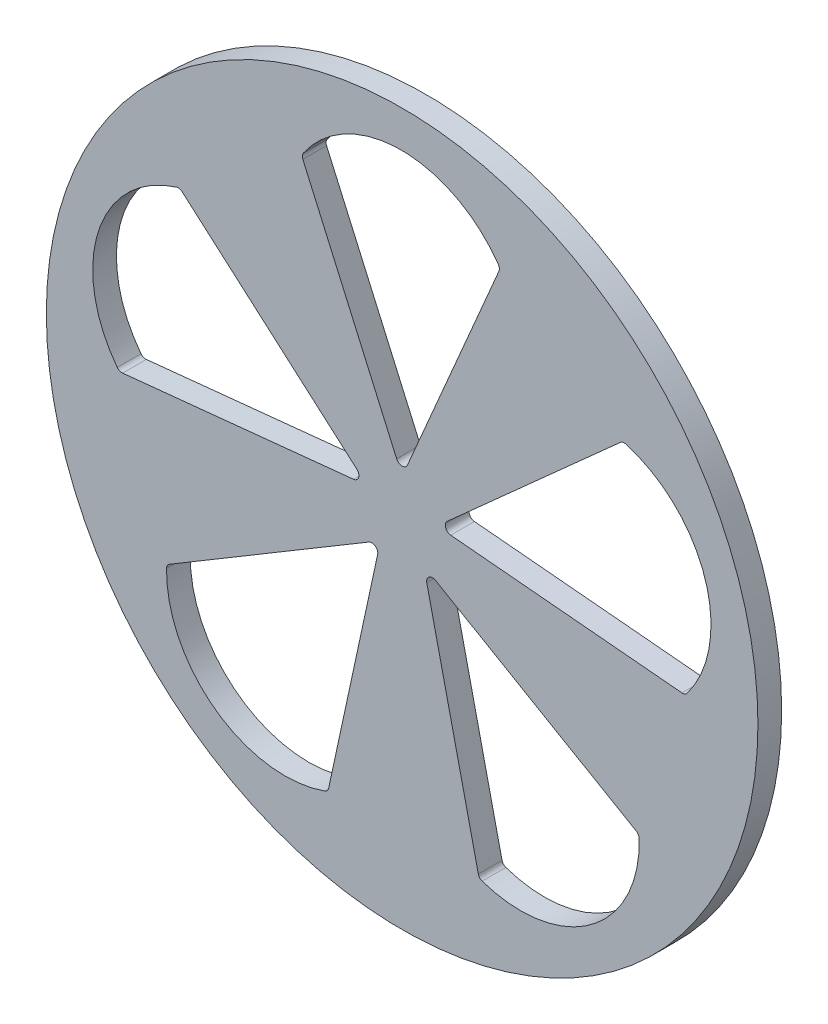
ISO-10303-21;
HEADER;
FILE_DESCRIPTION(('STEP AP214'),'2;1');
FILE_NAME('part.step','',(''),(''),'','','');
FILE_SCHEMA(('AUTOMOTIVE_DESIGN { 1 0 10303 214 1 1 1 1 }'));
ENDSEC;
DATA;
#1=APPLICATION_CONTEXT('core data for automotive mechanical design processes');
#2=APPLICATION_PROTOCOL_DEFINITION('international standard','automotive_design',2000,#1);
#3=PRODUCT_CONTEXT('',#1,'mechanical');
#4=PRODUCT('Part','Part','',(#3));
#5=PRODUCT_RELATED_PRODUCT_CATEGORY('part','',(#4));
#6=PRODUCT_DEFINITION_FORMATION('','',#4);
#7=PRODUCT_DEFINITION_CONTEXT('part definition',#1,'design');
#8=PRODUCT_DEFINITION('design','',#6,#7);
#9=PRODUCT_DEFINITION_SHAPE('','',#8);
#10=(LENGTH_UNIT() NAMED_UNIT(*) SI_UNIT(.MILLI.,.METRE.));
#11=(NAMED_UNIT(*) PLANE_ANGLE_UNIT() SI_UNIT($,.RADIAN.));
#12=(NAMED_UNIT(*) SI_UNIT($,.STERADIAN.) SOLID_ANGLE_UNIT());
#13=UNCERTAINTY_MEASURE_WITH_UNIT(LENGTH_MEASURE(1.E-05),#10,'distance_accuracy_value','');
#14=(GEOMETRIC_REPRESENTATION_CONTEXT(3) GLOBAL_UNCERTAINTY_ASSIGNED_CONTEXT((#13)) GLOBAL_UNIT_ASSIGNED_CONTEXT((#10,
#11,#12)) REPRESENTATION_CONTEXT('',''));
#15=CARTESIAN_POINT('',(0.,0.,0.));
#16=DIRECTION('',(0.,0.,1.));
#17=DIRECTION('',(1.,0.,0.));
#18=AXIS2_PLACEMENT_3D('',#15,#16,#17);
#19=CARTESIAN_POINT('',(0.,0.,2.));
#20=DIRECTION('',(0.,0.,1.));
#21=DIRECTION('',(1.,0.,0.));
#22=AXIS2_PLACEMENT_3D('',#19,#20,#21);
#23=PLANE('',#22);
#24=CARTESIAN_POINT('',(0.,0.,2.));
#25=DIRECTION('',(0.,0.,1.));
#26=DIRECTION('',(1.,0.,0.));
#27=AXIS2_PLACEMENT_3D('',#24,#25,#26);
#28=CIRCLE('',#27,30.);
#29=CARTESIAN_POINT('',(30.,0.,2.));
#30=VERTEX_POINT('',#29);
#31=EDGE_CURVE('E272',#30,#30,#28,.T.);
#32=ORIENTED_EDGE('',*,*,#31,.T.);
#33=EDGE_LOOP('',(#32));
#34=FACE_BOUND('',#33,.T.);
#35=DIRECTION('',(0.393631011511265,0.919268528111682,0.));
#36=VECTOR('',#35,1.);
#37=CARTESIAN_POINT('',(0.,3.101464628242,2.));
#38=LINE('',#37,#36);
#39=CARTESIAN_POINT('',(0.452644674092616,4.15855106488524,2.));
#40=VERTEX_POINT('',#39);
#41=CARTESIAN_POINT('',(8.15842856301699,22.1542993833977,2.));
#42=VERTEX_POINT('',#41);
#43=EDGE_CURVE('E567',#40,#42,#38,.T.);
#44=ORIENTED_EDGE('',*,*,#43,.F.);
#45=CARTESIAN_POINT('',(-0.00698958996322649,4.35536657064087,2.));
#46=DIRECTION('',(0.,0.,1.));
#47=DIRECTION('',(1.,0.,0.));
#48=AXIS2_PLACEMENT_3D('',#45,#46,#47);
#49=CIRCLE('',#48,0.5);
#50=CARTESIAN_POINT('',(-0.464401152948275,4.15343920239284,2.));
#51=VERTEX_POINT('',#50);
#52=EDGE_CURVE('E59',#40,#51,#49,.F.);
#53=ORIENTED_EDGE('',*,*,#52,.T.);
#54=DIRECTION('',(0.403854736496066,-0.914823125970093,0.));
#55=VECTOR('',#54,1.);
#56=CARTESIAN_POINT('',(-8.48094946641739,22.312750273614,2.));
#57=LINE('',#56,#55);
#58=CARTESIAN_POINT('',(-8.37032632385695,22.0621636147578,2.));
#59=VERTEX_POINT('',#58);
#60=EDGE_CURVE('E564',#59,#51,#57,.T.);
#61=ORIENTED_EDGE('',*,*,#60,.F.);
#62=CARTESIAN_POINT('',(-7.9129147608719,22.2640909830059,2.));
#63=DIRECTION('',(0.,0.,1.));
#64=DIRECTION('',(1.,0.,0.));
#65=AXIS2_PLACEMENT_3D('',#62,#63,#64);
#66=CIRCLE('',#65,0.5);
#67=CARTESIAN_POINT('',(-8.32533770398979,22.5467698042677,2.));
#68=VERTEX_POINT('',#67);
#69=EDGE_CURVE('E431',#59,#68,#66,.F.);
#70=ORIENTED_EDGE('',*,*,#69,.T.);
#71=CARTESIAN_POINT('',(-0.076878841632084,16.8931933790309,2.));
#72=DIRECTION('',(0.,0.,1.));
#73=DIRECTION('',(1.,0.,0.));
#74=AXIS2_PLACEMENT_3D('',#71,#72,#73);
#75=CIRCLE('',#74,10.);
#76=CARTESIAN_POINT('',(8.10804025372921,22.6383739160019,2.));
#77=VERTEX_POINT('',#76);
#78=EDGE_CURVE('E572',#77,#68,#75,.T.);
#79=ORIENTED_EDGE('',*,*,#78,.F.);
#80=CARTESIAN_POINT('',(7.69879429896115,22.3511148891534,2.));
#81=DIRECTION('',(0.,0.,1.));
#82=DIRECTION('',(1.,0.,0.));
#83=AXIS2_PLACEMENT_3D('',#80,#81,#82);
#84=CIRCLE('',#83,0.5);
#85=EDGE_CURVE('E425',#77,#42,#84,.F.);
#86=ORIENTED_EDGE('',*,*,#85,.T.);
#87=EDGE_LOOP('',(#44,#53,#61,#70,#79,#86));
#88=FACE_BOUND('',#87,.T.);
#89=CARTESIAN_POINT('',(16.0426247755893,5.29339996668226,2.));
#90=DIRECTION('',(0.,0.,1.));
#91=DIRECTION('',(1.,0.,0.));
#92=AXIS2_PLACEMENT_3D('',#89,#90,#91);
#93=CIRCLE('',#92,10.);
#94=CARTESIAN_POINT('',(24.0358952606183,-0.715562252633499,2.));
#95=VERTEX_POINT('',#94);
#96=CARTESIAN_POINT('',(18.8705815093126,14.8852017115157,2.));
#97=VERTEX_POINT('',#96);
#98=EDGE_CURVE('E544',#95,#97,#93,.T.);
#99=ORIENTED_EDGE('',*,*,#98,.F.);
#100=CARTESIAN_POINT('',(23.6362317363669,-0.415114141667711,2.));
#101=DIRECTION('',(0.,0.,1.));
#102=DIRECTION('',(1.,0.,0.));
#103=AXIS2_PLACEMENT_3D('',#100,#101,#102);
#104=CIRCLE('',#103,0.5);
#105=CARTESIAN_POINT('',(23.5910838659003,-0.913071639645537,2.));
#106=VERTEX_POINT('',#105);
#107=EDGE_CURVE('E419',#95,#106,#104,.F.);
#108=ORIENTED_EDGE('',*,*,#107,.T.);
#109=DIRECTION('',(0.995914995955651,-0.0902957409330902,0.));
#110=VECTOR('',#109,1.);
#111=CARTESIAN_POINT('',(2.94966814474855,0.95840527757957,2.));
#112=LINE('',#111,#110);
#113=CARTESIAN_POINT('',(4.09489198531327,0.854572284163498,2.));
#114=VERTEX_POINT('',#113);
#115=EDGE_CURVE('E540',#114,#106,#112,.T.);
#116=ORIENTED_EDGE('',*,*,#115,.F.);
#117=CARTESIAN_POINT('',(4.14003985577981,1.35252978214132,2.));
#118=DIRECTION('',(0.,0.,1.));
#119=DIRECTION('',(1.,0.,0.));
#120=AXIS2_PLACEMENT_3D('',#117,#118,#119);
#121=CIRCLE('',#120,0.5);
#122=CARTESIAN_POINT('',(3.80664757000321,1.72515504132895,2.));
#123=VERTEX_POINT('',#122);
#124=EDGE_CURVE('E442',#114,#123,#121,.F.);
#125=ORIENTED_EDGE('',*,*,#124,.T.);
#126=DIRECTION('',(-0.745250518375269,-0.666784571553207,0.));
#127=VECTOR('',#126,1.);
#128=CARTESIAN_POINT('',(18.5999290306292,14.9608812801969,2.));
#129=LINE('',#128,#127);
#130=CARTESIAN_POINT('',(18.3957913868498,14.7782368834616,2.));
#131=VERTEX_POINT('',#130);
#132=EDGE_CURVE('E549',#131,#123,#129,.T.);
#133=ORIENTED_EDGE('',*,*,#132,.F.);
#134=CARTESIAN_POINT('',(18.7291836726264,14.405611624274,2.));
#135=DIRECTION('',(0.,0.,1.));
#136=DIRECTION('',(1.,0.,0.));
#137=AXIS2_PLACEMENT_3D('',#134,#135,#136);
#138=CIRCLE('',#137,0.5);
#139=EDGE_CURVE('E388',#131,#97,#138,.F.);
#140=ORIENTED_EDGE('',*,*,#139,.T.);
#141=EDGE_LOOP('',(#99,#108,#116,#125,#133,#140));
#142=FACE_BOUND('',#141,.T.);
#143=CARTESIAN_POINT('',(9.99176622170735,-13.6216922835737,2.));
#144=DIRECTION('',(0.,0.,1.));
#145=DIRECTION('',(1.,0.,0.));
#146=AXIS2_PLACEMENT_3D('',#143,#144,#145);
#147=CIRCLE('',#146,10.);
#148=CARTESIAN_POINT('',(6.74695996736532,-23.0806157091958,2.));
#149=VERTEX_POINT('',#148);
#150=CARTESIAN_POINT('',(19.9879984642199,-13.3472092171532,2.));
#151=VERTEX_POINT('',#150);
#152=EDGE_CURVE('E528',#149,#151,#147,.T.);
#153=ORIENTED_EDGE('',*,*,#152,.F.);
#154=CARTESIAN_POINT('',(6.90920028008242,-22.6076695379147,2.));
#155=DIRECTION('',(0.,0.,1.));
#156=DIRECTION('',(1.,0.,0.));
#157=AXIS2_PLACEMENT_3D('',#154,#155,#156);
#158=CIRCLE('',#157,0.5);
#159=CARTESIAN_POINT('',(6.42166309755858,-22.7186086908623,2.));
#160=VERTEX_POINT('',#159);
#161=EDGE_CURVE('E255',#149,#160,#158,.F.);
#162=ORIENTED_EDGE('',*,*,#161,.T.);
#163=DIRECTION('',(0.221878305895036,-0.975074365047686,0.));
#164=VECTOR('',#163,1.);
#165=CARTESIAN_POINT('',(1.82299516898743,-2.50913759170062,2.));
#166=LINE('',#165,#164);
#167=CARTESIAN_POINT('',(2.07813775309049,-3.63039634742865,2.));
#168=VERTEX_POINT('',#167);
#169=EDGE_CURVE('E524',#168,#160,#166,.T.);
#170=ORIENTED_EDGE('',*,*,#169,.F.);
#171=CARTESIAN_POINT('',(2.56567493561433,-3.51945719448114,2.));
#172=DIRECTION('',(0.,0.,1.));
#173=DIRECTION('',(1.,0.,0.));
#174=AXIS2_PLACEMENT_3D('',#171,#172,#173);
#175=CIRCLE('',#174,0.5);
#176=CARTESIAN_POINT('',(2.81703873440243,-3.08723475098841,2.));
#177=VERTEX_POINT('',#176);
#178=EDGE_CURVE('E448',#168,#177,#175,.F.);
#179=ORIENTED_EDGE('',*,*,#178,.T.);
#180=DIRECTION('',(-0.864444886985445,0.502727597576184,0.));
#181=VECTOR('',#180,1.);
#182=CARTESIAN_POINT('',(19.9763377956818,-13.0664171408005,2.));
#183=LINE('',#182,#181);
#184=CARTESIAN_POINT('',(19.7395506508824,-12.9287109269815,2.));
#185=VERTEX_POINT('',#184);
#186=EDGE_CURVE('E531',#185,#177,#183,.T.);
#187=ORIENTED_EDGE('',*,*,#186,.F.);
#188=CARTESIAN_POINT('',(19.4881868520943,-13.3609333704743,2.));
#189=DIRECTION('',(0.,0.,1.));
#190=DIRECTION('',(1.,0.,0.));
#191=AXIS2_PLACEMENT_3D('',#188,#189,#190);
#192=CIRCLE('',#191,0.5);
#193=EDGE_CURVE('E382',#185,#151,#192,.F.);
#194=ORIENTED_EDGE('',*,*,#193,.T.);
#195=EDGE_LOOP('',(#153,#162,#170,#179,#187,#194));
#196=FACE_BOUND('',#195,.T.);
#197=CARTESIAN_POINT('',(-9.86737364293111,-13.7120687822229,2.));
#198=DIRECTION('',(0.,0.,1.));
#199=DIRECTION('',(1.,0.,0.));
#200=AXIS2_PLACEMENT_3D('',#197,#198,#199);
#201=CIRCLE('',#200,10.);
#202=CARTESIAN_POINT('',(-19.8660446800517,-13.5490427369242,2.));
#203=VERTEX_POINT('',#202);
#204=CARTESIAN_POINT('',(-6.51731909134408,-23.1342306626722,2.));
#205=VERTEX_POINT('',#204);
#206=EDGE_CURVE('E509',#203,#205,#201,.T.);
#207=ORIENTED_EDGE('',*,*,#206,.F.);
#208=CARTESIAN_POINT('',(-19.3661111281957,-13.5571940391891,2.));
#209=DIRECTION('',(0.,0.,1.));
#210=DIRECTION('',(1.,0.,0.));
#211=AXIS2_PLACEMENT_3D('',#208,#209,#210);
#212=CIRCLE('',#211,0.5);
#213=CARTESIAN_POINT('',(-19.6222778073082,-13.127800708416,2.));
#214=VERTEX_POINT('',#213);
#215=EDGE_CURVE('E256',#203,#214,#212,.F.);
#216=ORIENTED_EDGE('',*,*,#215,.T.);
#217=DIRECTION('',(-0.858786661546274,-0.512333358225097,0.));
#218=VECTOR('',#217,1.);
#219=CARTESIAN_POINT('',(-1.82299516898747,-2.5091375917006,2.));
#220=LINE('',#219,#218);
#221=CARTESIAN_POINT('',(-2.81053222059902,-3.09828061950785,2.));
#222=VERTEX_POINT('',#221);
#223=EDGE_CURVE('E505',#222,#214,#220,.T.);
#224=ORIENTED_EDGE('',*,*,#223,.F.);
#225=CARTESIAN_POINT('',(-2.55436554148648,-3.52767395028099,2.));
#226=DIRECTION('',(0.,0.,1.));
#227=DIRECTION('',(1.,0.,0.));
#228=AXIS2_PLACEMENT_3D('',#225,#226,#227);
#229=CIRCLE('',#228,0.5);
#230=CARTESIAN_POINT('',(-2.06562188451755,-3.6331710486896,2.));
#231=VERTEX_POINT('',#230);
#232=EDGE_CURVE('E454',#222,#231,#229,.F.);
#233=ORIENTED_EDGE('',*,*,#232,.T.);
#234=DIRECTION('',(0.210994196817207,0.977487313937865,0.));
#235=VECTOR('',#234,1.);
#236=CARTESIAN_POINT('',(-6.25387330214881,-23.0363711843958,2.));
#237=LINE('',#236,#235);
#238=CARTESIAN_POINT('',(-6.1960781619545,-22.7686196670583,2.));
#239=VERTEX_POINT('',#238);
#240=EDGE_CURVE('E514',#239,#231,#237,.T.);
#241=ORIENTED_EDGE('',*,*,#240,.F.);
#242=CARTESIAN_POINT('',(-6.68482181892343,-22.6631225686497,2.));
#243=DIRECTION('',(0.,0.,1.));
#244=DIRECTION('',(1.,0.,0.));
#245=AXIS2_PLACEMENT_3D('',#242,#243,#244);
#246=CIRCLE('',#245,0.5);
#247=EDGE_CURVE('E413',#239,#205,#246,.F.);
#248=ORIENTED_EDGE('',*,*,#247,.T.);
#249=EDGE_LOOP('',(#207,#216,#224,#233,#241,#248));
#250=FACE_BOUND('',#249,.T.);
#251=CARTESIAN_POINT('',(-16.0901385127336,5.14716772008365,2.));
#252=DIRECTION('',(0.,0.,1.));
#253=DIRECTION('',(1.,0.,0.));
#254=AXIS2_PLACEMENT_3D('',#251,#252,#253);
#255=CIRCLE('',#254,10.0000000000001);
#256=CARTESIAN_POINT('',(-19.0248508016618,14.7068467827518,2.));
#257=VERTEX_POINT('',#256);
#258=CARTESIAN_POINT('',(-24.0159231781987,-0.950531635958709,2.));
#259=VERTEX_POINT('',#258);
#260=EDGE_CURVE('E488',#257,#259,#255,.T.);
#261=ORIENTED_EDGE('',*,*,#260,.F.);
#262=CARTESIAN_POINT('',(-18.8781151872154,14.2288628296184,2.));
#263=DIRECTION('',(0.,0.,1.));
#264=DIRECTION('',(1.,0.,0.));
#265=AXIS2_PLACEMENT_3D('',#262,#263,#264);
#266=CIRCLE('',#265,0.5);
#267=CARTESIAN_POINT('',(-18.5488977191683,14.6051816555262,2.));
#268=VERTEX_POINT('',#267);
#269=EDGE_CURVE('E394',#257,#268,#266,.F.);
#270=ORIENTED_EDGE('',*,*,#269,.T.);
#271=DIRECTION('',(-0.752637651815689,0.658434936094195,0.));
#272=VECTOR('',#271,1.);
#273=CARTESIAN_POINT('',(-2.94966814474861,0.958405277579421,2.));
#274=LINE('',#273,#272);
#275=CARTESIAN_POINT('',(-3.81514219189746,1.71555361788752,2.));
#276=VERTEX_POINT('',#275);
#277=EDGE_CURVE('E482',#276,#268,#274,.T.);
#278=ORIENTED_EDGE('',*,*,#277,.F.);
#279=CARTESIAN_POINT('',(-4.14435965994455,1.33923479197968,2.));
#280=DIRECTION('',(0.,0.,1.));
#281=DIRECTION('',(1.,0.,0.));
#282=AXIS2_PLACEMENT_3D('',#279,#280,#281);
#283=CIRCLE('',#282,0.5);
#284=CARTESIAN_POINT('',(-4.09366326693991,0.841811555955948,2.));
#285=VERTEX_POINT('',#284);
#286=EDGE_CURVE('E11',#276,#285,#283,.F.);
#287=ORIENTED_EDGE('',*,*,#286,.T.);
#288=DIRECTION('',(0.99484647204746,0.101392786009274,0.));
#289=VECTOR('',#288,1.);
#290=CARTESIAN_POINT('',(-23.8414440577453,-1.17084322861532,2.));
#291=LINE('',#290,#289);
#292=CARTESIAN_POINT('',(-23.5689375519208,-1.14306990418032,2.));
#293=VERTEX_POINT('',#292);
#294=EDGE_CURVE('E480',#293,#285,#291,.T.);
#295=ORIENTED_EDGE('',*,*,#294,.F.);
#296=CARTESIAN_POINT('',(-23.6196339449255,-0.645646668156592,2.));
#297=DIRECTION('',(0.,0.,1.));
#298=DIRECTION('',(1.,0.,0.));
#299=AXIS2_PLACEMENT_3D('',#296,#297,#298);
#300=CIRCLE('',#299,0.5);
#301=EDGE_CURVE('E407',#293,#259,#300,.F.);
#302=ORIENTED_EDGE('',*,*,#301,.T.);
#303=EDGE_LOOP('',(#261,#270,#278,#287,#295,#302));
#304=FACE_BOUND('',#303,.T.);
#305=ADVANCED_FACE('F43',(#34,#88,#142,#196,#250,#304),#23,.T.);
#306=CARTESIAN_POINT('',(0.,0.,0.));
#307=DIRECTION('',(0.,0.,1.));
#308=DIRECTION('',(1.,0.,0.));
#309=AXIS2_PLACEMENT_3D('',#306,#307,#308);
#310=PLANE('',#309);
#311=DIRECTION('',(0.210994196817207,0.977487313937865,0.));
#312=VECTOR('',#311,1.);
#313=CARTESIAN_POINT('',(-6.25387330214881,-23.0363711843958,0.));
#314=LINE('',#313,#312);
#315=CARTESIAN_POINT('',(-6.1960781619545,-22.7686196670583,0.));
#316=VERTEX_POINT('',#315);
#317=CARTESIAN_POINT('',(-2.06562188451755,-3.6331710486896,0.));
#318=VERTEX_POINT('',#317);
#319=EDGE_CURVE('E510',#316,#318,#314,.T.);
#320=ORIENTED_EDGE('',*,*,#319,.T.);
#321=CARTESIAN_POINT('',(-2.55436554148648,-3.52767395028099,0.));
#322=DIRECTION('',(0.,0.,1.));
#323=DIRECTION('',(1.,0.,0.));
#324=AXIS2_PLACEMENT_3D('',#321,#322,#323);
#325=CIRCLE('',#324,0.5);
#326=CARTESIAN_POINT('',(-2.81053222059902,-3.09828061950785,0.));
#327=VERTEX_POINT('',#326);
#328=EDGE_CURVE('E451',#318,#327,#325,.T.);
#329=ORIENTED_EDGE('',*,*,#328,.T.);
#330=DIRECTION('',(-0.858786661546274,-0.512333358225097,0.));
#331=VECTOR('',#330,1.);
#332=CARTESIAN_POINT('',(-1.82299516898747,-2.5091375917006,0.));
#333=LINE('',#332,#331);
#334=CARTESIAN_POINT('',(-19.6222778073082,-13.127800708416,0.));
#335=VERTEX_POINT('',#334);
#336=EDGE_CURVE('E487',#327,#335,#333,.T.);
#337=ORIENTED_EDGE('',*,*,#336,.T.);
#338=CARTESIAN_POINT('',(-19.3661111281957,-13.5571940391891,0.));
#339=DIRECTION('',(0.,0.,1.));
#340=DIRECTION('',(1.,0.,0.));
#341=AXIS2_PLACEMENT_3D('',#338,#339,#340);
#342=CIRCLE('',#341,0.5);
#343=CARTESIAN_POINT('',(-19.8660446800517,-13.5490427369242,0.));
#344=VERTEX_POINT('',#343);
#345=EDGE_CURVE('E397',#335,#344,#342,.T.);
#346=ORIENTED_EDGE('',*,*,#345,.T.);
#347=CARTESIAN_POINT('',(-9.86737364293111,-13.7120687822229,0.));
#348=DIRECTION('',(0.,0.,1.));
#349=DIRECTION('',(1.,0.,0.));
#350=AXIS2_PLACEMENT_3D('',#347,#348,#349);
#351=CIRCLE('',#350,10.);
#352=CARTESIAN_POINT('',(-6.51731909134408,-23.1342306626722,0.));
#353=VERTEX_POINT('',#352);
#354=EDGE_CURVE('E494',#344,#353,#351,.T.);
#355=ORIENTED_EDGE('',*,*,#354,.T.);
#356=CARTESIAN_POINT('',(-6.68482181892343,-22.6631225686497,0.));
#357=DIRECTION('',(0.,0.,1.));
#358=DIRECTION('',(1.,0.,0.));
#359=AXIS2_PLACEMENT_3D('',#356,#357,#358);
#360=CIRCLE('',#359,0.5);
#361=EDGE_CURVE('E410',#353,#316,#360,.T.);
#362=ORIENTED_EDGE('',*,*,#361,.T.);
#363=EDGE_LOOP('',(#320,#329,#337,#346,#355,#362));
#364=FACE_BOUND('',#363,.T.);
#365=DIRECTION('',(-0.745250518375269,-0.666784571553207,0.));
#366=VECTOR('',#365,1.);
#367=CARTESIAN_POINT('',(18.5999290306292,14.9608812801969,0.));
#368=LINE('',#367,#366);
#369=CARTESIAN_POINT('',(18.3957913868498,14.7782368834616,0.));
#370=VERTEX_POINT('',#369);
#371=CARTESIAN_POINT('',(3.80664757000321,1.72515504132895,0.));
#372=VERTEX_POINT('',#371);
#373=EDGE_CURVE('E545',#370,#372,#368,.T.);
#374=ORIENTED_EDGE('',*,*,#373,.T.);
#375=CARTESIAN_POINT('',(4.14003985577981,1.35252978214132,0.));
#376=DIRECTION('',(0.,0.,1.));
#377=DIRECTION('',(1.,0.,0.));
#378=AXIS2_PLACEMENT_3D('',#375,#376,#377);
#379=CIRCLE('',#378,0.5);
#380=CARTESIAN_POINT('',(4.09489198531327,0.854572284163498,0.));
#381=VERTEX_POINT('',#380);
#382=EDGE_CURVE('E439',#372,#381,#379,.T.);
#383=ORIENTED_EDGE('',*,*,#382,.T.);
#384=DIRECTION('',(0.995914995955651,-0.0902957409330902,0.));
#385=VECTOR('',#384,1.);
#386=CARTESIAN_POINT('',(2.94966814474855,0.95840527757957,0.));
#387=LINE('',#386,#385);
#388=CARTESIAN_POINT('',(23.5910838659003,-0.913071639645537,0.));
#389=VERTEX_POINT('',#388);
#390=EDGE_CURVE('E535',#381,#389,#387,.T.);
#391=ORIENTED_EDGE('',*,*,#390,.T.);
#392=CARTESIAN_POINT('',(23.6362317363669,-0.415114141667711,0.));
#393=DIRECTION('',(0.,0.,1.));
#394=DIRECTION('',(1.,0.,0.));
#395=AXIS2_PLACEMENT_3D('',#392,#393,#394);
#396=CIRCLE('',#395,0.5);
#397=CARTESIAN_POINT('',(24.0358952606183,-0.715562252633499,0.));
#398=VERTEX_POINT('',#397);
#399=EDGE_CURVE('E416',#389,#398,#396,.T.);
#400=ORIENTED_EDGE('',*,*,#399,.T.);
#401=CARTESIAN_POINT('',(16.0426247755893,5.29339996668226,0.));
#402=DIRECTION('',(0.,0.,1.));
#403=DIRECTION('',(1.,0.,0.));
#404=AXIS2_PLACEMENT_3D('',#401,#402,#403);
#405=CIRCLE('',#404,10.);
#406=CARTESIAN_POINT('',(18.8705815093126,14.8852017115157,0.));
#407=VERTEX_POINT('',#406);
#408=EDGE_CURVE('E557',#398,#407,#405,.T.);
#409=ORIENTED_EDGE('',*,*,#408,.T.);
#410=CARTESIAN_POINT('',(18.7291836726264,14.405611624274,0.));
#411=DIRECTION('',(0.,0.,1.));
#412=DIRECTION('',(1.,0.,0.));
#413=AXIS2_PLACEMENT_3D('',#410,#411,#412);
#414=CIRCLE('',#413,0.5);
#415=EDGE_CURVE('E385',#407,#370,#414,.T.);
#416=ORIENTED_EDGE('',*,*,#415,.T.);
#417=EDGE_LOOP('',(#374,#383,#391,#400,#409,#416));
#418=FACE_BOUND('',#417,.T.);
#419=CARTESIAN_POINT('',(0.,0.,0.));
#420=DIRECTION('',(0.,0.,1.));
#421=DIRECTION('',(1.,0.,0.));
#422=AXIS2_PLACEMENT_3D('',#419,#420,#421);
#423=CIRCLE('',#422,30.);
#424=CARTESIAN_POINT('',(30.,0.,0.));
#425=VERTEX_POINT('',#424);
#426=EDGE_CURVE('E280',#425,#425,#423,.T.);
#427=ORIENTED_EDGE('',*,*,#426,.F.);
#428=EDGE_LOOP('',(#427));
#429=FACE_BOUND('',#428,.T.);
#430=CARTESIAN_POINT('',(-0.076878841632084,16.8931933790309,0.));
#431=DIRECTION('',(0.,0.,1.));
#432=DIRECTION('',(1.,0.,0.));
#433=AXIS2_PLACEMENT_3D('',#430,#431,#432);
#434=CIRCLE('',#433,10.);
#435=CARTESIAN_POINT('',(8.10804025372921,22.6383739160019,0.));
#436=VERTEX_POINT('',#435);
#437=CARTESIAN_POINT('',(-8.32533770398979,22.5467698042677,0.));
#438=VERTEX_POINT('',#437);
#439=EDGE_CURVE('E568',#436,#438,#434,.T.);
#440=ORIENTED_EDGE('',*,*,#439,.T.);
#441=CARTESIAN_POINT('',(-7.9129147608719,22.2640909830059,0.));
#442=DIRECTION('',(0.,0.,1.));
#443=DIRECTION('',(1.,0.,0.));
#444=AXIS2_PLACEMENT_3D('',#441,#442,#443);
#445=CIRCLE('',#444,0.5);
#446=CARTESIAN_POINT('',(-8.37032632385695,22.0621636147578,0.));
#447=VERTEX_POINT('',#446);
#448=EDGE_CURVE('E428',#438,#447,#445,.T.);
#449=ORIENTED_EDGE('',*,*,#448,.T.);
#450=DIRECTION('',(0.403854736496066,-0.914823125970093,0.));
#451=VECTOR('',#450,1.);
#452=CARTESIAN_POINT('',(-8.48094946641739,22.312750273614,0.));
#453=LINE('',#452,#451);
#454=CARTESIAN_POINT('',(-0.464401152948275,4.15343920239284,0.));
#455=VERTEX_POINT('',#454);
#456=EDGE_CURVE('E553',#447,#455,#453,.T.);
#457=ORIENTED_EDGE('',*,*,#456,.T.);
#458=CARTESIAN_POINT('',(-0.00698958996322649,4.35536657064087,0.));
#459=DIRECTION('',(0.,0.,1.));
#460=DIRECTION('',(1.,0.,0.));
#461=AXIS2_PLACEMENT_3D('',#458,#459,#460);
#462=CIRCLE('',#461,0.5);
#463=CARTESIAN_POINT('',(0.452644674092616,4.15855106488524,0.));
#464=VERTEX_POINT('',#463);
#465=EDGE_CURVE('E434',#455,#464,#462,.T.);
#466=ORIENTED_EDGE('',*,*,#465,.T.);
#467=DIRECTION('',(0.393631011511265,0.919268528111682,0.));
#468=VECTOR('',#467,1.);
#469=CARTESIAN_POINT('',(0.,3.101464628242,0.));
#470=LINE('',#469,#468);
#471=CARTESIAN_POINT('',(8.15842856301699,22.1542993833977,0.));
#472=VERTEX_POINT('',#471);
#473=EDGE_CURVE('E579',#464,#472,#470,.T.);
#474=ORIENTED_EDGE('',*,*,#473,.T.);
#475=CARTESIAN_POINT('',(7.69879429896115,22.3511148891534,0.));
#476=DIRECTION('',(0.,0.,1.));
#477=DIRECTION('',(1.,0.,0.));
#478=AXIS2_PLACEMENT_3D('',#475,#476,#477);
#479=CIRCLE('',#478,0.5);
#480=EDGE_CURVE('E422',#472,#436,#479,.T.);
#481=ORIENTED_EDGE('',*,*,#480,.T.);
#482=EDGE_LOOP('',(#440,#449,#457,#466,#474,#481));
#483=FACE_BOUND('',#482,.T.);
#484=DIRECTION('',(-0.864444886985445,0.502727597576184,0.));
#485=VECTOR('',#484,1.);
#486=CARTESIAN_POINT('',(19.9763377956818,-13.0664171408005,0.));
#487=LINE('',#486,#485);
#488=CARTESIAN_POINT('',(19.7395506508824,-12.9287109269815,0.));
#489=VERTEX_POINT('',#488);
#490=CARTESIAN_POINT('',(2.81703873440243,-3.08723475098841,0.));
#491=VERTEX_POINT('',#490);
#492=EDGE_CURVE('E267',#489,#491,#487,.T.);
#493=ORIENTED_EDGE('',*,*,#492,.T.);
#494=CARTESIAN_POINT('',(2.56567493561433,-3.51945719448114,0.));
#495=DIRECTION('',(0.,0.,1.));
#496=DIRECTION('',(1.,0.,0.));
#497=AXIS2_PLACEMENT_3D('',#494,#495,#496);
#498=CIRCLE('',#497,0.5);
#499=CARTESIAN_POINT('',(2.07813775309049,-3.63039634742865,0.));
#500=VERTEX_POINT('',#499);
#501=EDGE_CURVE('E445',#491,#500,#498,.T.);
#502=ORIENTED_EDGE('',*,*,#501,.T.);
#503=DIRECTION('',(0.221878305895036,-0.975074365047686,0.));
#504=VECTOR('',#503,1.);
#505=CARTESIAN_POINT('',(1.82299516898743,-2.50913759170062,0.));
#506=LINE('',#505,#504);
#507=CARTESIAN_POINT('',(6.42166309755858,-22.7186086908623,0.));
#508=VERTEX_POINT('',#507);
#509=EDGE_CURVE('E249',#500,#508,#506,.T.);
#510=ORIENTED_EDGE('',*,*,#509,.T.);
#511=CARTESIAN_POINT('',(6.90920028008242,-22.6076695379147,0.));
#512=DIRECTION('',(0.,0.,1.));
#513=DIRECTION('',(1.,0.,0.));
#514=AXIS2_PLACEMENT_3D('',#511,#512,#513);
#515=CIRCLE('',#514,0.5);
#516=CARTESIAN_POINT('',(6.74695996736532,-23.0806157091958,0.));
#517=VERTEX_POINT('',#516);
#518=EDGE_CURVE('E242',#508,#517,#515,.T.);
#519=ORIENTED_EDGE('',*,*,#518,.T.);
#520=CARTESIAN_POINT('',(9.99176622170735,-13.6216922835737,0.));
#521=DIRECTION('',(0.,0.,1.));
#522=DIRECTION('',(1.,0.,0.));
#523=AXIS2_PLACEMENT_3D('',#520,#521,#522);
#524=CIRCLE('',#523,10.);
#525=CARTESIAN_POINT('',(19.9879984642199,-13.3472092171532,0.));
#526=VERTEX_POINT('',#525);
#527=EDGE_CURVE('E247',#517,#526,#524,.T.);
#528=ORIENTED_EDGE('',*,*,#527,.T.);
#529=CARTESIAN_POINT('',(19.4881868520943,-13.3609333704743,0.));
#530=DIRECTION('',(0.,0.,1.));
#531=DIRECTION('',(1.,0.,0.));
#532=AXIS2_PLACEMENT_3D('',#529,#530,#531);
#533=CIRCLE('',#532,0.5);
#534=EDGE_CURVE('E379',#526,#489,#533,.T.);
#535=ORIENTED_EDGE('',*,*,#534,.T.);
#536=EDGE_LOOP('',(#493,#502,#510,#519,#528,#535));
#537=FACE_BOUND('',#536,.T.);
#538=DIRECTION('',(0.99484647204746,0.101392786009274,0.));
#539=VECTOR('',#538,1.);
#540=CARTESIAN_POINT('',(-23.8414440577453,-1.17084322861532,0.));
#541=LINE('',#540,#539);
#542=CARTESIAN_POINT('',(-23.5689375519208,-1.14306990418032,0.));
#543=VERTEX_POINT('',#542);
#544=CARTESIAN_POINT('',(-4.09366326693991,0.841811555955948,0.));
#545=VERTEX_POINT('',#544);
#546=EDGE_CURVE('E463',#543,#545,#541,.T.);
#547=ORIENTED_EDGE('',*,*,#546,.T.);
#548=CARTESIAN_POINT('',(-4.14435965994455,1.33923479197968,0.));
#549=DIRECTION('',(0.,0.,1.));
#550=DIRECTION('',(1.,0.,0.));
#551=AXIS2_PLACEMENT_3D('',#548,#549,#550);
#552=CIRCLE('',#551,0.5);
#553=CARTESIAN_POINT('',(-3.81514219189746,1.71555361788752,0.));
#554=VERTEX_POINT('',#553);
#555=EDGE_CURVE('E52',#545,#554,#552,.T.);
#556=ORIENTED_EDGE('',*,*,#555,.T.);
#557=DIRECTION('',(-0.752637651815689,0.658434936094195,0.));
#558=VECTOR('',#557,1.);
#559=CARTESIAN_POINT('',(-2.94966814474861,0.958405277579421,0.));
#560=LINE('',#559,#558);
#561=CARTESIAN_POINT('',(-18.5488977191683,14.6051816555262,0.));
#562=VERTEX_POINT('',#561);
#563=EDGE_CURVE('E461',#554,#562,#560,.T.);
#564=ORIENTED_EDGE('',*,*,#563,.T.);
#565=CARTESIAN_POINT('',(-18.8781151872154,14.2288628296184,0.));
#566=DIRECTION('',(0.,0.,1.));
#567=DIRECTION('',(1.,0.,0.));
#568=AXIS2_PLACEMENT_3D('',#565,#566,#567);
#569=CIRCLE('',#568,0.5);
#570=CARTESIAN_POINT('',(-19.0248508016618,14.7068467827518,0.));
#571=VERTEX_POINT('',#570);
#572=EDGE_CURVE('E391',#562,#571,#569,.T.);
#573=ORIENTED_EDGE('',*,*,#572,.T.);
#574=CARTESIAN_POINT('',(-16.0901385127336,5.14716772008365,0.));
#575=DIRECTION('',(0.,0.,1.));
#576=DIRECTION('',(1.,0.,0.));
#577=AXIS2_PLACEMENT_3D('',#574,#575,#576);
#578=CIRCLE('',#577,10.0000000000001);
#579=CARTESIAN_POINT('',(-24.0159231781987,-0.950531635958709,0.));
#580=VERTEX_POINT('',#579);
#581=EDGE_CURVE('E473',#571,#580,#578,.T.);
#582=ORIENTED_EDGE('',*,*,#581,.T.);
#583=CARTESIAN_POINT('',(-23.6196339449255,-0.645646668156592,0.));
#584=DIRECTION('',(0.,0.,1.));
#585=DIRECTION('',(1.,0.,0.));
#586=AXIS2_PLACEMENT_3D('',#583,#584,#585);
#587=CIRCLE('',#586,0.5);
#588=EDGE_CURVE('E404',#580,#543,#587,.T.);
#589=ORIENTED_EDGE('',*,*,#588,.T.);
#590=EDGE_LOOP('',(#547,#556,#564,#573,#582,#589));
#591=FACE_BOUND('',#590,.T.);
#592=ADVANCED_FACE('F245',(#364,#418,#429,#483,#537,#591),#310,.F.);
#593=CARTESIAN_POINT('',(0.,0.,2.));
#594=DIRECTION('',(0.,0.,-1.));
#595=DIRECTION('',(-1.,0.,0.));
#596=AXIS2_PLACEMENT_3D('',#593,#594,#595);
#597=CYLINDRICAL_SURFACE('',#596,30.);
#598=ORIENTED_EDGE('',*,*,#31,.F.);
#599=EDGE_LOOP('',(#598));
#600=FACE_BOUND('',#599,.T.);
#601=ORIENTED_EDGE('',*,*,#426,.T.);
#602=EDGE_LOOP('',(#601));
#603=FACE_BOUND('',#602,.T.);
#604=ADVANCED_FACE('F626',(#600,#603),#597,.T.);
#605=CARTESIAN_POINT('',(-8.48094946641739,22.312750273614,2.));
#606=DIRECTION('',(0.914823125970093,0.403854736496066,0.));
#607=DIRECTION('',(-0.403854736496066,0.914823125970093,0.));
#608=AXIS2_PLACEMENT_3D('',#605,#606,#607);
#609=PLANE('',#608);
#610=ORIENTED_EDGE('',*,*,#456,.F.);
#611=DIRECTION('',(0.,0.,1.));
#612=VECTOR('',#611,1.);
#613=CARTESIAN_POINT('',(-8.37032632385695,22.0621636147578,2.));
#614=LINE('',#613,#612);
#615=EDGE_CURVE('E66',#447,#59,#614,.T.);
#616=ORIENTED_EDGE('',*,*,#615,.T.);
#617=ORIENTED_EDGE('',*,*,#60,.T.);
#618=DIRECTION('',(0.,0.,-1.));
#619=VECTOR('',#618,1.);
#620=CARTESIAN_POINT('',(-0.464401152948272,4.15343920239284,0.));
#621=LINE('',#620,#619);
#622=EDGE_CURVE('E373',#51,#455,#621,.T.);
#623=ORIENTED_EDGE('',*,*,#622,.T.);
#624=EDGE_LOOP('',(#610,#616,#617,#623));
#625=FACE_BOUND('',#624,.T.);
#626=ADVANCED_FACE('F605',(#625),#609,.T.);
#627=CARTESIAN_POINT('',(0.,3.101464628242,2.));
#628=DIRECTION('',(-0.919268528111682,0.393631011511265,0.));
#629=DIRECTION('',(-0.393631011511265,-0.919268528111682,0.));
#630=AXIS2_PLACEMENT_3D('',#627,#628,#629);
#631=PLANE('',#630);
#632=ORIENTED_EDGE('',*,*,#43,.T.);
#633=DIRECTION('',(0.,0.,1.));
#634=VECTOR('',#633,1.);
#635=CARTESIAN_POINT('',(8.15842856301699,22.1542993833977,0.));
#636=LINE('',#635,#634);
#637=EDGE_CURVE('E362',#42,#472,#636,.F.);
#638=ORIENTED_EDGE('',*,*,#637,.T.);
#639=ORIENTED_EDGE('',*,*,#473,.F.);
#640=DIRECTION('',(0.,0.,-1.));
#641=VECTOR('',#640,1.);
#642=CARTESIAN_POINT('',(0.452644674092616,4.15855106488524,2.));
#643=LINE('',#642,#641);
#644=EDGE_CURVE('E359',#464,#40,#643,.F.);
#645=ORIENTED_EDGE('',*,*,#644,.T.);
#646=EDGE_LOOP('',(#632,#638,#639,#645));
#647=FACE_BOUND('',#646,.T.);
#648=ADVANCED_FACE('F599',(#647),#631,.T.);
#649=CARTESIAN_POINT('',(-0.076878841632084,16.8931933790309,2.));
#650=DIRECTION('',(0.,0.,-1.));
#651=DIRECTION('',(-1.,0.,0.));
#652=AXIS2_PLACEMENT_3D('',#649,#650,#651);
#653=CYLINDRICAL_SURFACE('',#652,10.);
#654=ORIENTED_EDGE('',*,*,#439,.F.);
#655=DIRECTION('',(0.,0.,-1.));
#656=VECTOR('',#655,1.);
#657=CARTESIAN_POINT('',(8.10804025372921,22.6383739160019,2.));
#658=LINE('',#657,#656);
#659=EDGE_CURVE('E370',#436,#77,#658,.F.);
#660=ORIENTED_EDGE('',*,*,#659,.T.);
#661=ORIENTED_EDGE('',*,*,#78,.T.);
#662=DIRECTION('',(0.,0.,-1.));
#663=VECTOR('',#662,1.);
#664=CARTESIAN_POINT('',(-8.32533770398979,22.5467698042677,2.));
#665=LINE('',#664,#663);
#666=EDGE_CURVE('E366',#68,#438,#665,.T.);
#667=ORIENTED_EDGE('',*,*,#666,.T.);
#668=EDGE_LOOP('',(#654,#660,#661,#667));
#669=FACE_BOUND('',#668,.T.);
#670=ADVANCED_FACE('F590',(#669),#653,.F.);
#671=CARTESIAN_POINT('',(2.94966814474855,0.95840527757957,2.));
#672=DIRECTION('',(0.0902957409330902,0.995914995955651,0.));
#673=DIRECTION('',(-0.995914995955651,0.0902957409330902,0.));
#674=AXIS2_PLACEMENT_3D('',#671,#672,#673);
#675=PLANE('',#674);
#676=ORIENTED_EDGE('',*,*,#115,.T.);
#677=DIRECTION('',(0.,0.,1.));
#678=VECTOR('',#677,1.);
#679=CARTESIAN_POINT('',(23.5910838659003,-0.913071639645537,0.));
#680=LINE('',#679,#678);
#681=EDGE_CURVE('E355',#106,#389,#680,.F.);
#682=ORIENTED_EDGE('',*,*,#681,.T.);
#683=ORIENTED_EDGE('',*,*,#390,.F.);
#684=DIRECTION('',(0.,0.,-1.));
#685=VECTOR('',#684,1.);
#686=CARTESIAN_POINT('',(4.09489198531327,0.854572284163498,2.));
#687=LINE('',#686,#685);
#688=EDGE_CURVE('E352',#381,#114,#687,.F.);
#689=ORIENTED_EDGE('',*,*,#688,.T.);
#690=EDGE_LOOP('',(#676,#682,#683,#689));
#691=FACE_BOUND('',#690,.T.);
#692=ADVANCED_FACE('F672',(#691),#675,.T.);
#693=CARTESIAN_POINT('',(16.0426247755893,5.29339996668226,2.));
#694=DIRECTION('',(0.,0.,-1.));
#695=DIRECTION('',(-1.,0.,0.));
#696=AXIS2_PLACEMENT_3D('',#693,#694,#695);
#697=CYLINDRICAL_SURFACE('',#696,10.);
#698=ORIENTED_EDGE('',*,*,#98,.T.);
#699=DIRECTION('',(0.,0.,-1.));
#700=VECTOR('',#699,1.);
#701=CARTESIAN_POINT('',(18.8705815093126,14.8852017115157,2.));
#702=LINE('',#701,#700);
#703=EDGE_CURVE('E293',#97,#407,#702,.T.);
#704=ORIENTED_EDGE('',*,*,#703,.T.);
#705=ORIENTED_EDGE('',*,*,#408,.F.);
#706=DIRECTION('',(0.,0.,-1.));
#707=VECTOR('',#706,1.);
#708=CARTESIAN_POINT('',(24.0358952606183,-0.715562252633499,2.));
#709=LINE('',#708,#707);
#710=EDGE_CURVE('E290',#398,#95,#709,.F.);
#711=ORIENTED_EDGE('',*,*,#710,.T.);
#712=EDGE_LOOP('',(#698,#704,#705,#711));
#713=FACE_BOUND('',#712,.T.);
#714=ADVANCED_FACE('F685',(#713),#697,.F.);
#715=CARTESIAN_POINT('',(18.5999290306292,14.9608812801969,2.));
#716=DIRECTION('',(0.666784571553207,-0.745250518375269,0.));
#717=DIRECTION('',(0.745250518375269,0.666784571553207,0.));
#718=AXIS2_PLACEMENT_3D('',#715,#716,#717);
#719=PLANE('',#718);
#720=ORIENTED_EDGE('',*,*,#373,.F.);
#721=DIRECTION('',(0.,0.,1.));
#722=VECTOR('',#721,1.);
#723=CARTESIAN_POINT('',(18.3957913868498,14.7782368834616,2.));
#724=LINE('',#723,#722);
#725=EDGE_CURVE('E301',#370,#131,#724,.T.);
#726=ORIENTED_EDGE('',*,*,#725,.T.);
#727=ORIENTED_EDGE('',*,*,#132,.T.);
#728=DIRECTION('',(0.,0.,-1.));
#729=VECTOR('',#728,1.);
#730=CARTESIAN_POINT('',(3.80664757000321,1.72515504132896,0.));
#731=LINE('',#730,#729);
#732=EDGE_CURVE('E297',#123,#372,#731,.T.);
#733=ORIENTED_EDGE('',*,*,#732,.T.);
#734=EDGE_LOOP('',(#720,#726,#727,#733));
#735=FACE_BOUND('',#734,.T.);
#736=ADVANCED_FACE('F681',(#735),#719,.T.);
#737=CARTESIAN_POINT('',(1.82299516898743,-2.50913759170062,2.));
#738=DIRECTION('',(0.975074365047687,0.221878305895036,0.));
#739=DIRECTION('',(-0.221878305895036,0.975074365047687,0.));
#740=AXIS2_PLACEMENT_3D('',#737,#738,#739);
#741=PLANE('',#740);
#742=ORIENTED_EDGE('',*,*,#169,.T.);
#743=DIRECTION('',(0.,0.,1.));
#744=VECTOR('',#743,1.);
#745=CARTESIAN_POINT('',(6.42166309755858,-22.7186086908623,0.));
#746=LINE('',#745,#744);
#747=EDGE_CURVE('E335',#160,#508,#746,.F.);
#748=ORIENTED_EDGE('',*,*,#747,.T.);
#749=ORIENTED_EDGE('',*,*,#509,.F.);
#750=DIRECTION('',(0.,0.,-1.));
#751=VECTOR('',#750,1.);
#752=CARTESIAN_POINT('',(2.07813775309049,-3.63039634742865,2.));
#753=LINE('',#752,#751);
#754=EDGE_CURVE('E332',#500,#168,#753,.F.);
#755=ORIENTED_EDGE('',*,*,#754,.T.);
#756=EDGE_LOOP('',(#742,#748,#749,#755));
#757=FACE_BOUND('',#756,.T.);
#758=ADVANCED_FACE('F704',(#757),#741,.T.);
#759=CARTESIAN_POINT('',(9.99176622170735,-13.6216922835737,2.));
#760=DIRECTION('',(0.,0.,-1.));
#761=DIRECTION('',(-1.,0.,0.));
#762=AXIS2_PLACEMENT_3D('',#759,#760,#761);
#763=CYLINDRICAL_SURFACE('',#762,10.);
#764=ORIENTED_EDGE('',*,*,#152,.T.);
#765=DIRECTION('',(0.,0.,-1.));
#766=VECTOR('',#765,1.);
#767=CARTESIAN_POINT('',(19.9879984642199,-13.3472092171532,2.));
#768=LINE('',#767,#766);
#769=EDGE_CURVE('E265',#151,#526,#768,.T.);
#770=ORIENTED_EDGE('',*,*,#769,.T.);
#771=ORIENTED_EDGE('',*,*,#527,.F.);
#772=DIRECTION('',(0.,0.,-1.));
#773=VECTOR('',#772,1.);
#774=CARTESIAN_POINT('',(6.74695996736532,-23.0806157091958,2.));
#775=LINE('',#774,#773);
#776=EDGE_CURVE('E262',#517,#149,#775,.F.);
#777=ORIENTED_EDGE('',*,*,#776,.T.);
#778=EDGE_LOOP('',(#764,#770,#771,#777));
#779=FACE_BOUND('',#778,.T.);
#780=ADVANCED_FACE('F261',(#779),#763,.F.);
#781=CARTESIAN_POINT('',(19.9763377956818,-13.0664171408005,2.));
#782=DIRECTION('',(-0.502727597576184,-0.864444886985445,0.));
#783=DIRECTION('',(0.864444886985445,-0.502727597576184,0.));
#784=AXIS2_PLACEMENT_3D('',#781,#782,#783);
#785=PLANE('',#784);
#786=ORIENTED_EDGE('',*,*,#492,.F.);
#787=DIRECTION('',(0.,0.,1.));
#788=VECTOR('',#787,1.);
#789=CARTESIAN_POINT('',(19.7395506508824,-12.9287109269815,2.));
#790=LINE('',#789,#788);
#791=EDGE_CURVE('E287',#489,#185,#790,.T.);
#792=ORIENTED_EDGE('',*,*,#791,.T.);
#793=ORIENTED_EDGE('',*,*,#186,.T.);
#794=DIRECTION('',(0.,0.,-1.));
#795=VECTOR('',#794,1.);
#796=CARTESIAN_POINT('',(2.81703873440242,-3.08723475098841,0.));
#797=LINE('',#796,#795);
#798=EDGE_CURVE('E277',#177,#491,#797,.T.);
#799=ORIENTED_EDGE('',*,*,#798,.T.);
#800=EDGE_LOOP('',(#786,#792,#793,#799));
#801=FACE_BOUND('',#800,.T.);
#802=ADVANCED_FACE('F770',(#801),#785,.T.);
#803=CARTESIAN_POINT('',(-1.82299516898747,-2.5091375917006,2.));
#804=DIRECTION('',(0.512333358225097,-0.858786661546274,0.));
#805=DIRECTION('',(0.858786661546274,0.512333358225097,0.));
#806=AXIS2_PLACEMENT_3D('',#803,#804,#805);
#807=PLANE('',#806);
#808=ORIENTED_EDGE('',*,*,#223,.T.);
#809=DIRECTION('',(0.,0.,1.));
#810=VECTOR('',#809,1.);
#811=CARTESIAN_POINT('',(-19.6222778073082,-13.127800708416,0.));
#812=LINE('',#811,#810);
#813=EDGE_CURVE('E321',#214,#335,#812,.F.);
#814=ORIENTED_EDGE('',*,*,#813,.T.);
#815=ORIENTED_EDGE('',*,*,#336,.F.);
#816=DIRECTION('',(0.,0.,-1.));
#817=VECTOR('',#816,1.);
#818=CARTESIAN_POINT('',(-2.81053222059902,-3.09828061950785,2.));
#819=LINE('',#818,#817);
#820=EDGE_CURVE('E318',#327,#222,#819,.F.);
#821=ORIENTED_EDGE('',*,*,#820,.T.);
#822=EDGE_LOOP('',(#808,#814,#815,#821));
#823=FACE_BOUND('',#822,.T.);
#824=ADVANCED_FACE('F778',(#823),#807,.T.);
#825=CARTESIAN_POINT('',(-9.86737364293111,-13.7120687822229,2.));
#826=DIRECTION('',(0.,0.,-1.));
#827=DIRECTION('',(-1.,0.,0.));
#828=AXIS2_PLACEMENT_3D('',#825,#826,#827);
#829=CYLINDRICAL_SURFACE('',#828,10.);
#830=ORIENTED_EDGE('',*,*,#354,.F.);
#831=DIRECTION('',(0.,0.,-1.));
#832=VECTOR('',#831,1.);
#833=CARTESIAN_POINT('',(-19.8660446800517,-13.5490427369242,2.));
#834=LINE('',#833,#832);
#835=EDGE_CURVE('E329',#344,#203,#834,.F.);
#836=ORIENTED_EDGE('',*,*,#835,.T.);
#837=ORIENTED_EDGE('',*,*,#206,.T.);
#838=DIRECTION('',(0.,0.,-1.));
#839=VECTOR('',#838,1.);
#840=CARTESIAN_POINT('',(-6.51731909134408,-23.1342306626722,2.));
#841=LINE('',#840,#839);
#842=EDGE_CURVE('E325',#205,#353,#841,.T.);
#843=ORIENTED_EDGE('',*,*,#842,.T.);
#844=EDGE_LOOP('',(#830,#836,#837,#843));
#845=FACE_BOUND('',#844,.T.);
#846=ADVANCED_FACE('F787',(#845),#829,.F.);
#847=CARTESIAN_POINT('',(-6.25387330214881,-23.0363711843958,2.));
#848=DIRECTION('',(-0.977487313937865,0.210994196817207,0.));
#849=DIRECTION('',(-0.210994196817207,-0.977487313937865,0.));
#850=AXIS2_PLACEMENT_3D('',#847,#848,#849);
#851=PLANE('',#850);
#852=ORIENTED_EDGE('',*,*,#319,.F.);
#853=DIRECTION('',(0.,0.,1.));
#854=VECTOR('',#853,1.);
#855=CARTESIAN_POINT('',(-6.1960781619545,-22.7686196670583,2.));
#856=LINE('',#855,#854);
#857=EDGE_CURVE('E349',#316,#239,#856,.T.);
#858=ORIENTED_EDGE('',*,*,#857,.T.);
#859=ORIENTED_EDGE('',*,*,#240,.T.);
#860=DIRECTION('',(0.,0.,-1.));
#861=VECTOR('',#860,1.);
#862=CARTESIAN_POINT('',(-2.06562188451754,-3.63317104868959,0.));
#863=LINE('',#862,#861);
#864=EDGE_CURVE('E345',#231,#318,#863,.T.);
#865=ORIENTED_EDGE('',*,*,#864,.T.);
#866=EDGE_LOOP('',(#852,#858,#859,#865));
#867=FACE_BOUND('',#866,.T.);
#868=ADVANCED_FACE('F796',(#867),#851,.T.);
#869=CARTESIAN_POINT('',(-2.94966814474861,0.958405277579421,2.));
#870=DIRECTION('',(-0.658434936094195,-0.752637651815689,0.));
#871=DIRECTION('',(0.752637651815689,-0.658434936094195,0.));
#872=AXIS2_PLACEMENT_3D('',#869,#870,#871);
#873=PLANE('',#872);
#874=ORIENTED_EDGE('',*,*,#277,.T.);
#875=DIRECTION('',(0.,0.,1.));
#876=VECTOR('',#875,1.);
#877=CARTESIAN_POINT('',(-18.5488977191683,14.6051816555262,0.));
#878=LINE('',#877,#876);
#879=EDGE_CURVE('E307',#268,#562,#878,.F.);
#880=ORIENTED_EDGE('',*,*,#879,.T.);
#881=ORIENTED_EDGE('',*,*,#563,.F.);
#882=DIRECTION('',(0.,0.,-1.));
#883=VECTOR('',#882,1.);
#884=CARTESIAN_POINT('',(-3.81514219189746,1.71555361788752,2.));
#885=LINE('',#884,#883);
#886=EDGE_CURVE('E304',#554,#276,#885,.F.);
#887=ORIENTED_EDGE('',*,*,#886,.T.);
#888=EDGE_LOOP('',(#874,#880,#881,#887));
#889=FACE_BOUND('',#888,.T.);
#890=ADVANCED_FACE('F469',(#889),#873,.T.);
#891=CARTESIAN_POINT('',(-16.0901385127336,5.14716772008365,2.));
#892=DIRECTION('',(0.,0.,-1.));
#893=DIRECTION('',(-1.,0.,0.));
#894=AXIS2_PLACEMENT_3D('',#891,#892,#893);
#895=CYLINDRICAL_SURFACE('',#894,10.0000000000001);
#896=ORIENTED_EDGE('',*,*,#581,.F.);
#897=DIRECTION('',(0.,0.,-1.));
#898=VECTOR('',#897,1.);
#899=CARTESIAN_POINT('',(-19.0248508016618,14.7068467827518,2.));
#900=LINE('',#899,#898);
#901=EDGE_CURVE('E315',#571,#257,#900,.F.);
#902=ORIENTED_EDGE('',*,*,#901,.T.);
#903=ORIENTED_EDGE('',*,*,#260,.T.);
#904=DIRECTION('',(0.,0.,-1.));
#905=VECTOR('',#904,1.);
#906=CARTESIAN_POINT('',(-24.0159231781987,-0.950531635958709,2.));
#907=LINE('',#906,#905);
#908=EDGE_CURVE('E311',#259,#580,#907,.T.);
#909=ORIENTED_EDGE('',*,*,#908,.T.);
#910=EDGE_LOOP('',(#896,#902,#903,#909));
#911=FACE_BOUND('',#910,.T.);
#912=ADVANCED_FACE('F813',(#911),#895,.F.);
#913=CARTESIAN_POINT('',(-23.8414440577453,-1.17084322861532,2.));
#914=DIRECTION('',(-0.101392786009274,0.99484647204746,0.));
#915=DIRECTION('',(-0.99484647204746,-0.101392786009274,0.));
#916=AXIS2_PLACEMENT_3D('',#913,#914,#915);
#917=PLANE('',#916);
#918=ORIENTED_EDGE('',*,*,#546,.F.);
#919=DIRECTION('',(0.,0.,1.));
#920=VECTOR('',#919,1.);
#921=CARTESIAN_POINT('',(-23.5689375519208,-1.14306990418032,2.));
#922=LINE('',#921,#920);
#923=EDGE_CURVE('E342',#543,#293,#922,.T.);
#924=ORIENTED_EDGE('',*,*,#923,.T.);
#925=ORIENTED_EDGE('',*,*,#294,.T.);
#926=DIRECTION('',(0.,0.,-1.));
#927=VECTOR('',#926,1.);
#928=CARTESIAN_POINT('',(-4.09366326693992,0.841811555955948,0.));
#929=LINE('',#928,#927);
#930=EDGE_CURVE('E338',#285,#545,#929,.T.);
#931=ORIENTED_EDGE('',*,*,#930,.T.);
#932=EDGE_LOOP('',(#918,#924,#925,#931));
#933=FACE_BOUND('',#932,.T.);
#934=ADVANCED_FACE('F484',(#933),#917,.T.);
#935=CARTESIAN_POINT('',(19.4881868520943,-13.3609333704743,2.));
#936=DIRECTION('',(0.,0.,-1.));
#937=DIRECTION('',(-1.,0.,0.));
#938=AXIS2_PLACEMENT_3D('',#935,#936,#937);
#939=CYLINDRICAL_SURFACE('',#938,0.5);
#940=ORIENTED_EDGE('',*,*,#193,.F.);
#941=ORIENTED_EDGE('',*,*,#791,.F.);
#942=ORIENTED_EDGE('',*,*,#534,.F.);
#943=ORIENTED_EDGE('',*,*,#769,.F.);
#944=EDGE_LOOP('',(#940,#941,#942,#943));
#945=FACE_BOUND('',#944,.T.);
#946=ADVANCED_FACE('F634',(#945),#939,.F.);
#947=CARTESIAN_POINT('',(18.7291836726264,14.405611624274,2.));
#948=DIRECTION('',(0.,0.,-1.));
#949=DIRECTION('',(-1.,0.,0.));
#950=AXIS2_PLACEMENT_3D('',#947,#948,#949);
#951=CYLINDRICAL_SURFACE('',#950,0.5);
#952=ORIENTED_EDGE('',*,*,#139,.F.);
#953=ORIENTED_EDGE('',*,*,#725,.F.);
#954=ORIENTED_EDGE('',*,*,#415,.F.);
#955=ORIENTED_EDGE('',*,*,#703,.F.);
#956=EDGE_LOOP('',(#952,#953,#954,#955));
#957=FACE_BOUND('',#956,.T.);
#958=ADVANCED_FACE('F637',(#957),#951,.F.);
#959=CARTESIAN_POINT('',(-18.8781151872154,14.2288628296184,2.));
#960=DIRECTION('',(0.,0.,-1.));
#961=DIRECTION('',(-1.,0.,0.));
#962=AXIS2_PLACEMENT_3D('',#959,#960,#961);
#963=CYLINDRICAL_SURFACE('',#962,0.5);
#964=ORIENTED_EDGE('',*,*,#269,.F.);
#965=ORIENTED_EDGE('',*,*,#901,.F.);
#966=ORIENTED_EDGE('',*,*,#572,.F.);
#967=ORIENTED_EDGE('',*,*,#879,.F.);
#968=EDGE_LOOP('',(#964,#965,#966,#967));
#969=FACE_BOUND('',#968,.T.);
#970=ADVANCED_FACE('F641',(#969),#963,.F.);
#971=CARTESIAN_POINT('',(-19.3661111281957,-13.5571940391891,2.));
#972=DIRECTION('',(0.,0.,-1.));
#973=DIRECTION('',(-1.,0.,0.));
#974=AXIS2_PLACEMENT_3D('',#971,#972,#973);
#975=CYLINDRICAL_SURFACE('',#974,0.5);
#976=ORIENTED_EDGE('',*,*,#215,.F.);
#977=ORIENTED_EDGE('',*,*,#835,.F.);
#978=ORIENTED_EDGE('',*,*,#345,.F.);
#979=ORIENTED_EDGE('',*,*,#813,.F.);
#980=EDGE_LOOP('',(#976,#977,#978,#979));
#981=FACE_BOUND('',#980,.T.);
#982=ADVANCED_FACE('F645',(#981),#975,.F.);
#983=CARTESIAN_POINT('',(6.90920028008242,-22.6076695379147,2.));
#984=DIRECTION('',(0.,0.,-1.));
#985=DIRECTION('',(-1.,0.,0.));
#986=AXIS2_PLACEMENT_3D('',#983,#984,#985);
#987=CYLINDRICAL_SURFACE('',#986,0.5);
#988=ORIENTED_EDGE('',*,*,#161,.F.);
#989=ORIENTED_EDGE('',*,*,#776,.F.);
#990=ORIENTED_EDGE('',*,*,#518,.F.);
#991=ORIENTED_EDGE('',*,*,#747,.F.);
#992=EDGE_LOOP('',(#988,#989,#990,#991));
#993=FACE_BOUND('',#992,.T.);
#994=ADVANCED_FACE('F270',(#993),#987,.F.);
#995=CARTESIAN_POINT('',(-23.6196339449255,-0.645646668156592,2.));
#996=DIRECTION('',(0.,0.,-1.));
#997=DIRECTION('',(-1.,0.,0.));
#998=AXIS2_PLACEMENT_3D('',#995,#996,#997);
#999=CYLINDRICAL_SURFACE('',#998,0.5);
#1000=ORIENTED_EDGE('',*,*,#301,.F.);
#1001=ORIENTED_EDGE('',*,*,#923,.F.);
#1002=ORIENTED_EDGE('',*,*,#588,.F.);
#1003=ORIENTED_EDGE('',*,*,#908,.F.);
#1004=EDGE_LOOP('',(#1000,#1001,#1002,#1003));
#1005=FACE_BOUND('',#1004,.T.);
#1006=ADVANCED_FACE('F652',(#1005),#999,.F.);
#1007=CARTESIAN_POINT('',(-6.68482181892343,-22.6631225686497,2.));
#1008=DIRECTION('',(0.,0.,-1.));
#1009=DIRECTION('',(-1.,0.,0.));
#1010=AXIS2_PLACEMENT_3D('',#1007,#1008,#1009);
#1011=CYLINDRICAL_SURFACE('',#1010,0.5);
#1012=ORIENTED_EDGE('',*,*,#247,.F.);
#1013=ORIENTED_EDGE('',*,*,#857,.F.);
#1014=ORIENTED_EDGE('',*,*,#361,.F.);
#1015=ORIENTED_EDGE('',*,*,#842,.F.);
#1016=EDGE_LOOP('',(#1012,#1013,#1014,#1015));
#1017=FACE_BOUND('',#1016,.T.);
#1018=ADVANCED_FACE('F655',(#1017),#1011,.F.);
#1019=CARTESIAN_POINT('',(23.6362317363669,-0.415114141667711,2.));
#1020=DIRECTION('',(0.,0.,-1.));
#1021=DIRECTION('',(-1.,0.,0.));
#1022=AXIS2_PLACEMENT_3D('',#1019,#1020,#1021);
#1023=CYLINDRICAL_SURFACE('',#1022,0.5);
#1024=ORIENTED_EDGE('',*,*,#107,.F.);
#1025=ORIENTED_EDGE('',*,*,#710,.F.);
#1026=ORIENTED_EDGE('',*,*,#399,.F.);
#1027=ORIENTED_EDGE('',*,*,#681,.F.);
#1028=EDGE_LOOP('',(#1024,#1025,#1026,#1027));
#1029=FACE_BOUND('',#1028,.T.);
#1030=ADVANCED_FACE('F617',(#1029),#1023,.F.);
#1031=CARTESIAN_POINT('',(7.69879429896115,22.3511148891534,2.));
#1032=DIRECTION('',(0.,0.,-1.));
#1033=DIRECTION('',(-1.,0.,0.));
#1034=AXIS2_PLACEMENT_3D('',#1031,#1032,#1033);
#1035=CYLINDRICAL_SURFACE('',#1034,0.5);
#1036=ORIENTED_EDGE('',*,*,#85,.F.);
#1037=ORIENTED_EDGE('',*,*,#659,.F.);
#1038=ORIENTED_EDGE('',*,*,#480,.F.);
#1039=ORIENTED_EDGE('',*,*,#637,.F.);
#1040=EDGE_LOOP('',(#1036,#1037,#1038,#1039));
#1041=FACE_BOUND('',#1040,.T.);
#1042=ADVANCED_FACE('F595',(#1041),#1035,.F.);
#1043=CARTESIAN_POINT('',(-7.9129147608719,22.2640909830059,2.));
#1044=DIRECTION('',(0.,0.,-1.));
#1045=DIRECTION('',(-1.,0.,0.));
#1046=AXIS2_PLACEMENT_3D('',#1043,#1044,#1045);
#1047=CYLINDRICAL_SURFACE('',#1046,0.5);
#1048=ORIENTED_EDGE('',*,*,#69,.F.);
#1049=ORIENTED_EDGE('',*,*,#615,.F.);
#1050=ORIENTED_EDGE('',*,*,#448,.F.);
#1051=ORIENTED_EDGE('',*,*,#666,.F.);
#1052=EDGE_LOOP('',(#1048,#1049,#1050,#1051));
#1053=FACE_BOUND('',#1052,.T.);
#1054=ADVANCED_FACE('F608',(#1053),#1047,.F.);
#1055=CARTESIAN_POINT('',(-0.00698958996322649,4.35536657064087,2.));
#1056=DIRECTION('',(0.,0.,1.));
#1057=DIRECTION('',(1.,0.,0.));
#1058=AXIS2_PLACEMENT_3D('',#1055,#1056,#1057);
#1059=CYLINDRICAL_SURFACE('',#1058,0.5);
#1060=ORIENTED_EDGE('',*,*,#52,.F.);
#1061=ORIENTED_EDGE('',*,*,#644,.F.);
#1062=ORIENTED_EDGE('',*,*,#465,.F.);
#1063=ORIENTED_EDGE('',*,*,#622,.F.);
#1064=EDGE_LOOP('',(#1060,#1061,#1062,#1063));
#1065=FACE_BOUND('',#1064,.T.);
#1066=ADVANCED_FACE('F603',(#1065),#1059,.F.);
#1067=CARTESIAN_POINT('',(4.14003985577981,1.35252978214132,2.));
#1068=DIRECTION('',(0.,0.,1.));
#1069=DIRECTION('',(1.,0.,0.));
#1070=AXIS2_PLACEMENT_3D('',#1067,#1068,#1069);
#1071=CYLINDRICAL_SURFACE('',#1070,0.5);
#1072=ORIENTED_EDGE('',*,*,#124,.F.);
#1073=ORIENTED_EDGE('',*,*,#688,.F.);
#1074=ORIENTED_EDGE('',*,*,#382,.F.);
#1075=ORIENTED_EDGE('',*,*,#732,.F.);
#1076=EDGE_LOOP('',(#1072,#1073,#1074,#1075));
#1077=FACE_BOUND('',#1076,.T.);
#1078=ADVANCED_FACE('F615',(#1077),#1071,.F.);
#1079=CARTESIAN_POINT('',(2.56567493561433,-3.51945719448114,2.));
#1080=DIRECTION('',(0.,0.,1.));
#1081=DIRECTION('',(1.,0.,0.));
#1082=AXIS2_PLACEMENT_3D('',#1079,#1080,#1081);
#1083=CYLINDRICAL_SURFACE('',#1082,0.5);
#1084=ORIENTED_EDGE('',*,*,#178,.F.);
#1085=ORIENTED_EDGE('',*,*,#754,.F.);
#1086=ORIENTED_EDGE('',*,*,#501,.F.);
#1087=ORIENTED_EDGE('',*,*,#798,.F.);
#1088=EDGE_LOOP('',(#1084,#1085,#1086,#1087));
#1089=FACE_BOUND('',#1088,.T.);
#1090=ADVANCED_FACE('F889',(#1089),#1083,.F.);
#1091=CARTESIAN_POINT('',(-2.55436554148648,-3.52767395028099,2.));
#1092=DIRECTION('',(0.,0.,1.));
#1093=DIRECTION('',(1.,0.,0.));
#1094=AXIS2_PLACEMENT_3D('',#1091,#1092,#1093);
#1095=CYLINDRICAL_SURFACE('',#1094,0.5);
#1096=ORIENTED_EDGE('',*,*,#232,.F.);
#1097=ORIENTED_EDGE('',*,*,#820,.F.);
#1098=ORIENTED_EDGE('',*,*,#328,.F.);
#1099=ORIENTED_EDGE('',*,*,#864,.F.);
#1100=EDGE_LOOP('',(#1096,#1097,#1098,#1099));
#1101=FACE_BOUND('',#1100,.T.);
#1102=ADVANCED_FACE('F897',(#1101),#1095,.F.);
#1103=CARTESIAN_POINT('',(-4.14435965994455,1.33923479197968,2.));
#1104=DIRECTION('',(0.,0.,1.));
#1105=DIRECTION('',(1.,0.,0.));
#1106=AXIS2_PLACEMENT_3D('',#1103,#1104,#1105);
#1107=CYLINDRICAL_SURFACE('',#1106,0.5);
#1108=ORIENTED_EDGE('',*,*,#286,.F.);
#1109=ORIENTED_EDGE('',*,*,#886,.F.);
#1110=ORIENTED_EDGE('',*,*,#555,.F.);
#1111=ORIENTED_EDGE('',*,*,#930,.F.);
#1112=EDGE_LOOP('',(#1108,#1109,#1110,#1111));
#1113=FACE_BOUND('',#1112,.T.);
#1114=ADVANCED_FACE('F45',(#1113),#1107,.F.);
#1115=CLOSED_SHELL('',(#305,#592,#604,#626,#648,#670,#692,#714,#736,#758,#780,#802,#824,#846,
#868,#890,#912,#934,#946,#958,#970,#982,#994,#1006,#1018,#1030,#1042,#1054,#1066,#1078,#1090,
#1102,#1114));
#1116=MANIFOLD_SOLID_BREP('B2',#1115);
#1117=ADVANCED_BREP_SHAPE_REPRESENTATION('',(#18,#1116),#14);
#1118=SHAPE_DEFINITION_REPRESENTATION(#9,#1117);
ENDSEC;
END-ISO-10303-21;
